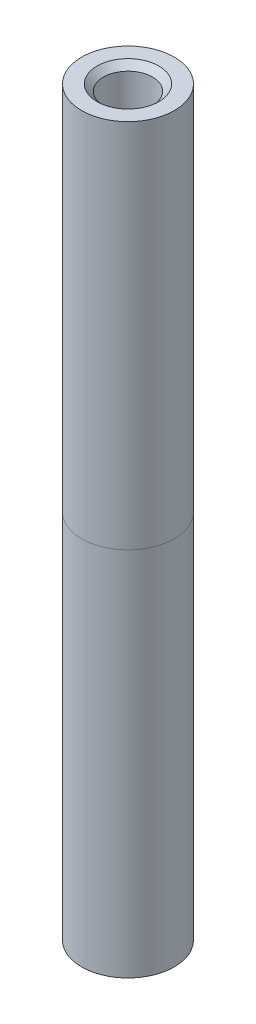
ISO-10303-21;
HEADER;
FILE_DESCRIPTION(('STEP AP214'),'2;1');
FILE_NAME('part.step','',(''),(''),'','','');
FILE_SCHEMA(('AUTOMOTIVE_DESIGN { 1 0 10303 214 1 1 1 1 }'));
ENDSEC;
DATA;
#1=APPLICATION_CONTEXT('core data for automotive mechanical design processes');
#2=APPLICATION_PROTOCOL_DEFINITION('international standard','automotive_design',2000,#1);
#3=PRODUCT_CONTEXT('',#1,'mechanical');
#4=PRODUCT('Part','Part','',(#3));
#5=PRODUCT_RELATED_PRODUCT_CATEGORY('part','',(#4));
#6=PRODUCT_DEFINITION_FORMATION('','',#4);
#7=PRODUCT_DEFINITION_CONTEXT('part definition',#1,'design');
#8=PRODUCT_DEFINITION('design','',#6,#7);
#9=PRODUCT_DEFINITION_SHAPE('','',#8);
#10=(LENGTH_UNIT() NAMED_UNIT(*) SI_UNIT(.MILLI.,.METRE.));
#11=(NAMED_UNIT(*) PLANE_ANGLE_UNIT() SI_UNIT($,.RADIAN.));
#12=(NAMED_UNIT(*) SI_UNIT($,.STERADIAN.) SOLID_ANGLE_UNIT());
#13=UNCERTAINTY_MEASURE_WITH_UNIT(LENGTH_MEASURE(1.E-05),#10,'distance_accuracy_value','');
#14=(GEOMETRIC_REPRESENTATION_CONTEXT(3) GLOBAL_UNCERTAINTY_ASSIGNED_CONTEXT((#13)) GLOBAL_UNIT_ASSIGNED_CONTEXT((#10,
#11,#12)) REPRESENTATION_CONTEXT('',''));
#15=CARTESIAN_POINT('',(0.,0.,0.));
#16=DIRECTION('',(0.,0.,1.));
#17=DIRECTION('',(1.,0.,0.));
#18=AXIS2_PLACEMENT_3D('',#15,#16,#17);
#19=CARTESIAN_POINT('',(0.,96.266,0.));
#20=DIRECTION('',(0.,1.,0.));
#21=DIRECTION('',(0.,0.,1.));
#22=AXIS2_PLACEMENT_3D('',#19,#20,#21);
#23=CYLINDRICAL_SURFACE('',#22,9.52500000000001);
#24=CARTESIAN_POINT('',(0.,-76.2,0.));
#25=DIRECTION('',(0.,1.,0.));
#26=DIRECTION('',(0.,0.,1.));
#27=AXIS2_PLACEMENT_3D('',#24,#25,#26);
#28=CIRCLE('',#27,9.52500000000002);
#29=CARTESIAN_POINT('',(0.,-76.2,9.52500000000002));
#30=VERTEX_POINT('',#29);
#31=EDGE_CURVE('E70',#30,#30,#28,.T.);
#32=ORIENTED_EDGE('',*,*,#31,.T.);
#33=EDGE_LOOP('',(#32));
#34=FACE_BOUND('',#33,.T.);
#35=CARTESIAN_POINT('',(0.,0.,0.));
#36=DIRECTION('',(0.,1.,0.));
#37=DIRECTION('',(0.,0.,1.));
#38=AXIS2_PLACEMENT_3D('',#35,#36,#37);
#39=CIRCLE('',#38,9.52500000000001);
#40=CARTESIAN_POINT('',(0.,0.,9.52500000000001));
#41=VERTEX_POINT('',#40);
#42=EDGE_CURVE('E10',#41,#41,#39,.T.);
#43=ORIENTED_EDGE('',*,*,#42,.F.);
#44=EDGE_LOOP('',(#43));
#45=FACE_BOUND('',#44,.T.);
#46=ADVANCED_FACE('F42',(#34,#45),#23,.T.);
#47=CARTESIAN_POINT('',(0.,53.34,0.));
#48=DIRECTION('',(0.,1.,0.));
#49=DIRECTION('',(0.,0.,1.));
#50=AXIS2_PLACEMENT_3D('',#47,#48,#49);
#51=CONICAL_SURFACE('',#50,5.04190000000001,1.04719755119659);
#52=CARTESIAN_POINT('',(0.,53.1786883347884,0.));
#53=DIRECTION('',(0.,1.,0.));
#54=DIRECTION('',(0.,0.,1.));
#55=AXIS2_PLACEMENT_3D('',#52,#53,#54);
#56=CIRCLE('',#55,4.76250000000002);
#57=CARTESIAN_POINT('',(0.,53.1786883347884,4.76250000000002));
#58=VERTEX_POINT('',#57);
#59=EDGE_CURVE('E85',#58,#58,#56,.T.);
#60=ORIENTED_EDGE('',*,*,#59,.F.);
#61=EDGE_LOOP('',(#60));
#62=FACE_BOUND('',#61,.T.);
#63=CARTESIAN_POINT('',(0.,53.34,0.));
#64=DIRECTION('',(0.,1.,0.));
#65=DIRECTION('',(0.,0.,1.));
#66=AXIS2_PLACEMENT_3D('',#63,#64,#65);
#67=CIRCLE('',#66,5.04190000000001);
#68=CARTESIAN_POINT('',(0.,53.34,5.04190000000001));
#69=VERTEX_POINT('',#68);
#70=EDGE_CURVE('E50',#69,#69,#67,.T.);
#71=ORIENTED_EDGE('',*,*,#70,.T.);
#72=EDGE_LOOP('',(#71));
#73=FACE_BOUND('',#72,.T.);
#74=ADVANCED_FACE('F44',(#62,#73),#51,.F.);
#75=CARTESIAN_POINT('',(0.,96.266,0.));
#76=DIRECTION('',(0.,1.,0.));
#77=DIRECTION('',(0.,0.,1.));
#78=AXIS2_PLACEMENT_3D('',#75,#76,#77);
#79=CYLINDRICAL_SURFACE('',#78,5.04190000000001);
#80=ORIENTED_EDGE('',*,*,#70,.F.);
#81=EDGE_LOOP('',(#80));
#82=FACE_BOUND('',#81,.T.);
#83=CARTESIAN_POINT('',(0.,74.8919,0.));
#84=DIRECTION('',(0.,1.,0.));
#85=DIRECTION('',(0.,0.,1.));
#86=AXIS2_PLACEMENT_3D('',#83,#84,#85);
#87=CIRCLE('',#86,5.04190000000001);
#88=CARTESIAN_POINT('',(0.,74.8919,5.04190000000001));
#89=VERTEX_POINT('',#88);
#90=EDGE_CURVE('E58',#89,#89,#87,.T.);
#91=ORIENTED_EDGE('',*,*,#90,.T.);
#92=EDGE_LOOP('',(#91));
#93=FACE_BOUND('',#92,.T.);
#94=ADVANCED_FACE('F92',(#82,#93),#79,.F.);
#95=CARTESIAN_POINT('',(0.,76.2,0.));
#96=DIRECTION('',(0.,1.,0.));
#97=DIRECTION('',(0.,0.,1.));
#98=AXIS2_PLACEMENT_3D('',#95,#96,#97);
#99=CONICAL_SURFACE('',#98,6.35,0.785398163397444);
#100=ORIENTED_EDGE('',*,*,#90,.F.);
#101=EDGE_LOOP('',(#100));
#102=FACE_BOUND('',#101,.T.);
#103=CARTESIAN_POINT('',(0.,76.2,0.));
#104=DIRECTION('',(0.,1.,0.));
#105=DIRECTION('',(0.,0.,1.));
#106=AXIS2_PLACEMENT_3D('',#103,#104,#105);
#107=CIRCLE('',#106,6.35);
#108=CARTESIAN_POINT('',(0.,76.2,6.35));
#109=VERTEX_POINT('',#108);
#110=EDGE_CURVE('E62',#109,#109,#107,.T.);
#111=ORIENTED_EDGE('',*,*,#110,.T.);
#112=EDGE_LOOP('',(#111));
#113=FACE_BOUND('',#112,.T.);
#114=ADVANCED_FACE('F97',(#102,#113),#99,.F.);
#115=CARTESIAN_POINT('',(6.35,76.2,0.));
#116=DIRECTION('',(0.,-1.,0.));
#117=DIRECTION('',(0.,0.,-1.));
#118=AXIS2_PLACEMENT_3D('',#115,#116,#117);
#119=PLANE('',#118);
#120=ORIENTED_EDGE('',*,*,#110,.F.);
#121=EDGE_LOOP('',(#120));
#122=FACE_BOUND('',#121,.T.);
#123=CARTESIAN_POINT('',(0.,76.2,0.));
#124=DIRECTION('',(0.,1.,0.));
#125=DIRECTION('',(0.,0.,1.));
#126=AXIS2_PLACEMENT_3D('',#123,#124,#125);
#127=CIRCLE('',#126,9.525);
#128=CARTESIAN_POINT('',(0.,76.2,9.525));
#129=VERTEX_POINT('',#128);
#130=EDGE_CURVE('E67',#129,#129,#127,.T.);
#131=ORIENTED_EDGE('',*,*,#130,.T.);
#132=EDGE_LOOP('',(#131));
#133=FACE_BOUND('',#132,.T.);
#134=ADVANCED_FACE('F108',(#122,#133),#119,.F.);
#135=ORIENTED_EDGE('',*,*,#42,.T.);
#136=EDGE_LOOP('',(#135));
#137=FACE_BOUND('',#136,.T.);
#138=ORIENTED_EDGE('',*,*,#130,.F.);
#139=EDGE_LOOP('',(#138));
#140=FACE_BOUND('',#139,.T.);
#141=ADVANCED_FACE('F101',(#137,#140),#23,.T.);
#142=CARTESIAN_POINT('',(6.35000000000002,-76.2,0.));
#143=DIRECTION('',(0.,1.,0.));
#144=DIRECTION('',(0.,0.,1.));
#145=AXIS2_PLACEMENT_3D('',#142,#143,#144);
#146=PLANE('',#145);
#147=ORIENTED_EDGE('',*,*,#31,.F.);
#148=EDGE_LOOP('',(#147));
#149=FACE_BOUND('',#148,.T.);
#150=CARTESIAN_POINT('',(0.,-76.2,0.));
#151=DIRECTION('',(0.,1.,0.));
#152=DIRECTION('',(0.,0.,1.));
#153=AXIS2_PLACEMENT_3D('',#150,#151,#152);
#154=CIRCLE('',#153,6.35000000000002);
#155=CARTESIAN_POINT('',(0.,-76.2,6.35000000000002));
#156=VERTEX_POINT('',#155);
#157=EDGE_CURVE('E73',#156,#156,#154,.T.);
#158=ORIENTED_EDGE('',*,*,#157,.T.);
#159=EDGE_LOOP('',(#158));
#160=FACE_BOUND('',#159,.T.);
#161=ADVANCED_FACE('F107',(#149,#160),#146,.F.);
#162=CARTESIAN_POINT('',(0.,-74.8919,0.));
#163=DIRECTION('',(0.,-1.,0.));
#164=DIRECTION('',(0.,0.,-1.));
#165=AXIS2_PLACEMENT_3D('',#162,#163,#164);
#166=CONICAL_SURFACE('',#165,5.04190000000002,0.785398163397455);
#167=ORIENTED_EDGE('',*,*,#157,.F.);
#168=EDGE_LOOP('',(#167));
#169=FACE_BOUND('',#168,.T.);
#170=CARTESIAN_POINT('',(0.,-74.8919,0.));
#171=DIRECTION('',(0.,1.,0.));
#172=DIRECTION('',(0.,0.,1.));
#173=AXIS2_PLACEMENT_3D('',#170,#171,#172);
#174=CIRCLE('',#173,5.04190000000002);
#175=CARTESIAN_POINT('',(0.,-74.8919,5.04190000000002));
#176=VERTEX_POINT('',#175);
#177=EDGE_CURVE('E76',#176,#176,#174,.T.);
#178=ORIENTED_EDGE('',*,*,#177,.T.);
#179=EDGE_LOOP('',(#178));
#180=FACE_BOUND('',#179,.T.);
#181=ADVANCED_FACE('F113',(#169,#180),#166,.F.);
#182=CARTESIAN_POINT('',(0.,96.266,0.));
#183=DIRECTION('',(0.,1.,0.));
#184=DIRECTION('',(0.,0.,1.));
#185=AXIS2_PLACEMENT_3D('',#182,#183,#184);
#186=CYLINDRICAL_SURFACE('',#185,5.04190000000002);
#187=ORIENTED_EDGE('',*,*,#177,.F.);
#188=EDGE_LOOP('',(#187));
#189=FACE_BOUND('',#188,.T.);
#190=CARTESIAN_POINT('',(0.,-53.34,0.));
#191=DIRECTION('',(0.,1.,0.));
#192=DIRECTION('',(0.,0.,1.));
#193=AXIS2_PLACEMENT_3D('',#190,#191,#192);
#194=CIRCLE('',#193,5.04190000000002);
#195=CARTESIAN_POINT('',(0.,-53.34,5.04190000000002));
#196=VERTEX_POINT('',#195);
#197=EDGE_CURVE('E79',#196,#196,#194,.T.);
#198=ORIENTED_EDGE('',*,*,#197,.T.);
#199=EDGE_LOOP('',(#198));
#200=FACE_BOUND('',#199,.T.);
#201=ADVANCED_FACE('F140',(#189,#200),#186,.F.);
#202=CARTESIAN_POINT('',(0.,-53.1786883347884,0.));
#203=DIRECTION('',(0.,-1.,0.));
#204=DIRECTION('',(0.,0.,-1.));
#205=AXIS2_PLACEMENT_3D('',#202,#203,#204);
#206=CONICAL_SURFACE('',#205,4.76250000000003,1.04719755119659);
#207=ORIENTED_EDGE('',*,*,#197,.F.);
#208=EDGE_LOOP('',(#207));
#209=FACE_BOUND('',#208,.T.);
#210=CARTESIAN_POINT('',(0.,-53.1786883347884,0.));
#211=DIRECTION('',(0.,1.,0.));
#212=DIRECTION('',(0.,0.,1.));
#213=AXIS2_PLACEMENT_3D('',#210,#211,#212);
#214=CIRCLE('',#213,4.76250000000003);
#215=CARTESIAN_POINT('',(0.,-53.1786883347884,4.76250000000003));
#216=VERTEX_POINT('',#215);
#217=EDGE_CURVE('E82',#216,#216,#214,.T.);
#218=ORIENTED_EDGE('',*,*,#217,.T.);
#219=EDGE_LOOP('',(#218));
#220=FACE_BOUND('',#219,.T.);
#221=ADVANCED_FACE('F143',(#209,#220),#206,.F.);
#222=CARTESIAN_POINT('',(0.,96.266,0.));
#223=DIRECTION('',(0.,1.,0.));
#224=DIRECTION('',(0.,0.,1.));
#225=AXIS2_PLACEMENT_3D('',#222,#223,#224);
#226=CYLINDRICAL_SURFACE('',#225,4.76250000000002);
#227=ORIENTED_EDGE('',*,*,#217,.F.);
#228=EDGE_LOOP('',(#227));
#229=FACE_BOUND('',#228,.T.);
#230=ORIENTED_EDGE('',*,*,#59,.T.);
#231=EDGE_LOOP('',(#230));
#232=FACE_BOUND('',#231,.T.);
#233=ADVANCED_FACE('F89',(#229,#232),#226,.F.);
#234=CLOSED_SHELL('',(#46,#74,#94,#114,#134,#141,#161,#181,#201,#221,#233));
#235=MANIFOLD_SOLID_BREP('B2',#234);
#236=ADVANCED_BREP_SHAPE_REPRESENTATION('',(#18,#235),#14);
#237=SHAPE_DEFINITION_REPRESENTATION(#9,#236);
ENDSEC;
END-ISO-10303-21;
